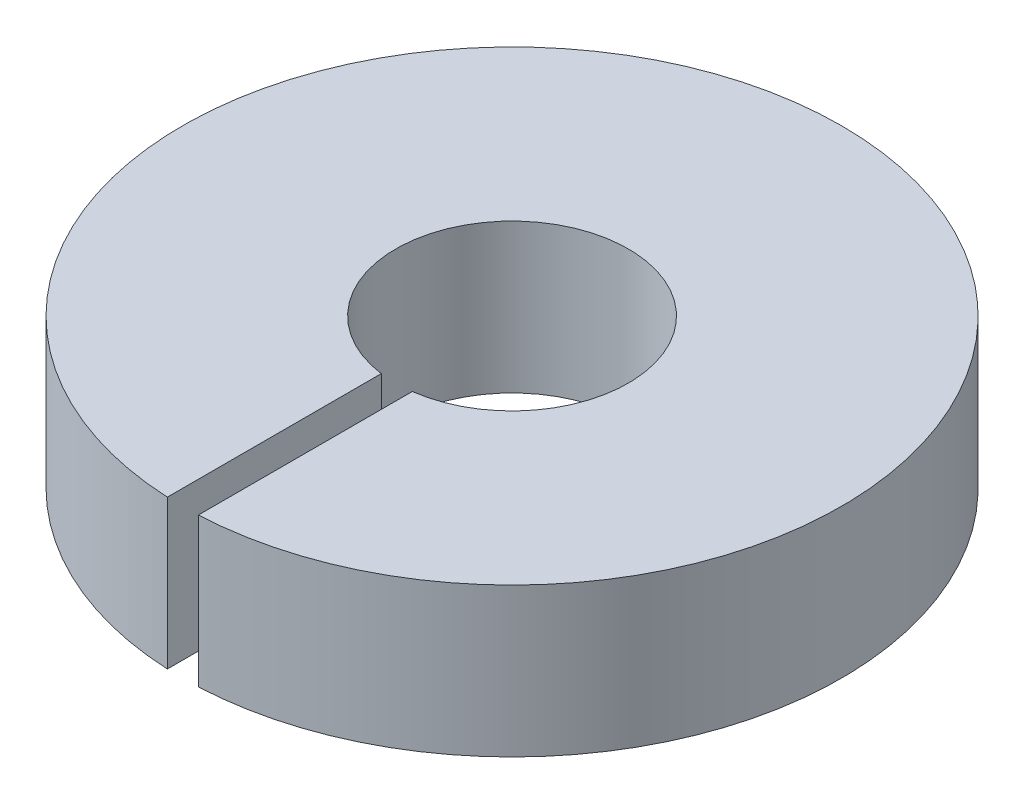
ISO-10303-21;
HEADER;
FILE_DESCRIPTION(('STEP AP214'),'2;1');
FILE_NAME('part.step','',(''),(''),'','','');
FILE_SCHEMA(('AUTOMOTIVE_DESIGN { 1 0 10303 214 1 1 1 1 }'));
ENDSEC;
DATA;
#1=APPLICATION_CONTEXT('core data for automotive mechanical design processes');
#2=APPLICATION_PROTOCOL_DEFINITION('international standard','automotive_design',2000,#1);
#3=PRODUCT_CONTEXT('',#1,'mechanical');
#4=PRODUCT('Part','Part','',(#3));
#5=PRODUCT_RELATED_PRODUCT_CATEGORY('part','',(#4));
#6=PRODUCT_DEFINITION_FORMATION('','',#4);
#7=PRODUCT_DEFINITION_CONTEXT('part definition',#1,'design');
#8=PRODUCT_DEFINITION('design','',#6,#7);
#9=PRODUCT_DEFINITION_SHAPE('','',#8);
#10=(LENGTH_UNIT() NAMED_UNIT(*) SI_UNIT(.MILLI.,.METRE.));
#11=(NAMED_UNIT(*) PLANE_ANGLE_UNIT() SI_UNIT($,.RADIAN.));
#12=(NAMED_UNIT(*) SI_UNIT($,.STERADIAN.) SOLID_ANGLE_UNIT());
#13=UNCERTAINTY_MEASURE_WITH_UNIT(LENGTH_MEASURE(1.E-05),#10,'distance_accuracy_value','');
#14=(GEOMETRIC_REPRESENTATION_CONTEXT(3) GLOBAL_UNCERTAINTY_ASSIGNED_CONTEXT((#13)) GLOBAL_UNIT_ASSIGNED_CONTEXT((#10,
#11,#12)) REPRESENTATION_CONTEXT('',''));
#15=CARTESIAN_POINT('',(0.,0.,0.));
#16=DIRECTION('',(0.,0.,1.));
#17=DIRECTION('',(1.,0.,0.));
#18=AXIS2_PLACEMENT_3D('',#15,#16,#17);
#19=CARTESIAN_POINT('',(0.,6.096,0.));
#20=DIRECTION('',(0.,-1.,0.));
#21=DIRECTION('',(0.,0.,-1.));
#22=AXIS2_PLACEMENT_3D('',#19,#20,#21);
#23=CYLINDRICAL_SURFACE('',#22,13.49375);
#24=CARTESIAN_POINT('',(0.,0.,0.));
#25=DIRECTION('',(0.,1.,0.));
#26=DIRECTION('',(0.,0.,1.));
#27=AXIS2_PLACEMENT_3D('',#24,#25,#26);
#28=CIRCLE('',#27,13.49375);
#29=CARTESIAN_POINT('',(0.635000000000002,0.,13.4788005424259));
#30=VERTEX_POINT('',#29);
#31=CARTESIAN_POINT('',(-0.634999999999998,0.,13.4788005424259));
#32=VERTEX_POINT('',#31);
#33=EDGE_CURVE('E100',#30,#32,#28,.T.);
#34=ORIENTED_EDGE('',*,*,#33,.T.);
#35=DIRECTION('',(0.,-1.,0.));
#36=VECTOR('',#35,1.);
#37=CARTESIAN_POINT('',(-0.634999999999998,6.096,13.4788005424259));
#38=LINE('',#37,#36);
#39=CARTESIAN_POINT('',(-0.634999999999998,6.096,13.4788005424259));
#40=VERTEX_POINT('',#39);
#41=EDGE_CURVE('E11',#40,#32,#38,.T.);
#42=ORIENTED_EDGE('',*,*,#41,.F.);
#43=CARTESIAN_POINT('',(0.,6.096,0.));
#44=DIRECTION('',(0.,1.,0.));
#45=DIRECTION('',(0.,0.,1.));
#46=AXIS2_PLACEMENT_3D('',#43,#44,#45);
#47=CIRCLE('',#46,13.49375);
#48=CARTESIAN_POINT('',(0.635000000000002,6.096,13.4788005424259));
#49=VERTEX_POINT('',#48);
#50=EDGE_CURVE('E87',#49,#40,#47,.T.);
#51=ORIENTED_EDGE('',*,*,#50,.F.);
#52=DIRECTION('',(0.,-1.,0.));
#53=VECTOR('',#52,1.);
#54=CARTESIAN_POINT('',(0.635000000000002,6.096,13.4788005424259));
#55=LINE('',#54,#53);
#56=EDGE_CURVE('E96',#49,#30,#55,.T.);
#57=ORIENTED_EDGE('',*,*,#56,.T.);
#58=EDGE_LOOP('',(#34,#42,#51,#57));
#59=FACE_BOUND('',#58,.T.);
#60=ADVANCED_FACE('F34',(#59),#23,.T.);
#61=CARTESIAN_POINT('',(-0.634999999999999,6.096,4.71997682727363));
#62=DIRECTION('',(-1.,0.,0.));
#63=DIRECTION('',(0.,0.,1.));
#64=AXIS2_PLACEMENT_3D('',#61,#62,#63);
#65=PLANE('',#64);
#66=CARTESIAN_POINT('',(-0.635000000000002,3.048,6.35));
#67=DIRECTION('',(-1.,0.,0.));
#68=DIRECTION('',(0.,0.,1.));
#69=AXIS2_PLACEMENT_3D('',#66,#67,#68);
#70=CIRCLE('',#69,1.1303);
#71=CARTESIAN_POINT('',(-0.635000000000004,3.048,5.2197));
#72=VERTEX_POINT('',#71);
#73=EDGE_CURVE('E103',#72,#72,#70,.T.);
#74=ORIENTED_EDGE('',*,*,#73,.T.);
#75=EDGE_LOOP('',(#74));
#76=FACE_BOUND('',#75,.T.);
#77=DIRECTION('',(0.,0.,-1.));
#78=VECTOR('',#77,1.);
#79=CARTESIAN_POINT('',(-0.634999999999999,0.,4.71997682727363));
#80=LINE('',#79,#78);
#81=CARTESIAN_POINT('',(-0.634999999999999,0.,4.71997682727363));
#82=VERTEX_POINT('',#81);
#83=EDGE_CURVE('E91',#32,#82,#80,.T.);
#84=ORIENTED_EDGE('',*,*,#83,.T.);
#85=DIRECTION('',(0.,-1.,0.));
#86=VECTOR('',#85,1.);
#87=CARTESIAN_POINT('',(-0.634999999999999,6.096,4.71997682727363));
#88=LINE('',#87,#86);
#89=CARTESIAN_POINT('',(-0.634999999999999,6.096,4.71997682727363));
#90=VERTEX_POINT('',#89);
#91=EDGE_CURVE('E43',#90,#82,#88,.T.);
#92=ORIENTED_EDGE('',*,*,#91,.F.);
#93=DIRECTION('',(0.,0.,-1.));
#94=VECTOR('',#93,1.);
#95=CARTESIAN_POINT('',(-0.634999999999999,6.096,4.71997682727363));
#96=LINE('',#95,#94);
#97=EDGE_CURVE('E82',#40,#90,#96,.T.);
#98=ORIENTED_EDGE('',*,*,#97,.F.);
#99=ORIENTED_EDGE('',*,*,#41,.T.);
#100=EDGE_LOOP('',(#84,#92,#98,#99));
#101=FACE_BOUND('',#100,.T.);
#102=ADVANCED_FACE('F90',(#76,#101),#65,.F.);
#103=CARTESIAN_POINT('',(0.,6.096,0.));
#104=DIRECTION('',(0.,-1.,0.));
#105=DIRECTION('',(0.,0.,-1.));
#106=AXIS2_PLACEMENT_3D('',#103,#104,#105);
#107=CYLINDRICAL_SURFACE('',#106,4.7625);
#108=CARTESIAN_POINT('',(0.,0.,0.));
#109=DIRECTION('',(0.,-1.,0.));
#110=DIRECTION('',(0.,0.,1.));
#111=AXIS2_PLACEMENT_3D('',#108,#109,#110);
#112=CIRCLE('',#111,4.7625);
#113=CARTESIAN_POINT('',(0.635,0.,4.71997682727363));
#114=VERTEX_POINT('',#113);
#115=EDGE_CURVE('E69',#82,#114,#112,.T.);
#116=ORIENTED_EDGE('',*,*,#115,.T.);
#117=DIRECTION('',(0.,-1.,0.));
#118=VECTOR('',#117,1.);
#119=CARTESIAN_POINT('',(0.635,6.096,4.71997682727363));
#120=LINE('',#119,#118);
#121=CARTESIAN_POINT('',(0.635,6.096,4.71997682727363));
#122=VERTEX_POINT('',#121);
#123=EDGE_CURVE('E92',#122,#114,#120,.T.);
#124=ORIENTED_EDGE('',*,*,#123,.F.);
#125=CARTESIAN_POINT('',(0.,6.096,0.));
#126=DIRECTION('',(0.,-1.,0.));
#127=DIRECTION('',(0.,0.,1.));
#128=AXIS2_PLACEMENT_3D('',#125,#126,#127);
#129=CIRCLE('',#128,4.7625);
#130=EDGE_CURVE('E85',#90,#122,#129,.T.);
#131=ORIENTED_EDGE('',*,*,#130,.F.);
#132=ORIENTED_EDGE('',*,*,#91,.T.);
#133=EDGE_LOOP('',(#116,#124,#131,#132));
#134=FACE_BOUND('',#133,.T.);
#135=ADVANCED_FACE('F94',(#134),#107,.F.);
#136=CARTESIAN_POINT('',(0.635000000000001,6.096,4.71997682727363));
#137=DIRECTION('',(1.,0.,0.));
#138=DIRECTION('',(0.,0.,-1.));
#139=AXIS2_PLACEMENT_3D('',#136,#137,#138);
#140=PLANE('',#139);
#141=CARTESIAN_POINT('',(0.634999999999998,3.048,6.35));
#142=DIRECTION('',(1.,0.,0.));
#143=DIRECTION('',(0.,0.,-1.));
#144=AXIS2_PLACEMENT_3D('',#141,#142,#143);
#145=CIRCLE('',#144,1.1303);
#146=CARTESIAN_POINT('',(0.634999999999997,3.048,5.2197));
#147=VERTEX_POINT('',#146);
#148=EDGE_CURVE('E108',#147,#147,#145,.T.);
#149=ORIENTED_EDGE('',*,*,#148,.T.);
#150=EDGE_LOOP('',(#149));
#151=FACE_BOUND('',#150,.T.);
#152=DIRECTION('',(0.,0.,1.));
#153=VECTOR('',#152,1.);
#154=CARTESIAN_POINT('',(0.635000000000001,0.,4.71997682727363));
#155=LINE('',#154,#153);
#156=EDGE_CURVE('E75',#114,#30,#155,.T.);
#157=ORIENTED_EDGE('',*,*,#156,.T.);
#158=ORIENTED_EDGE('',*,*,#56,.F.);
#159=DIRECTION('',(0.,0.,1.));
#160=VECTOR('',#159,1.);
#161=CARTESIAN_POINT('',(0.635000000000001,6.096,4.71997682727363));
#162=LINE('',#161,#160);
#163=EDGE_CURVE('E52',#122,#49,#162,.T.);
#164=ORIENTED_EDGE('',*,*,#163,.F.);
#165=ORIENTED_EDGE('',*,*,#123,.T.);
#166=EDGE_LOOP('',(#157,#158,#164,#165));
#167=FACE_BOUND('',#166,.T.);
#168=ADVANCED_FACE('F165',(#151,#167),#140,.F.);
#169=CARTESIAN_POINT('',(0.,6.096,0.));
#170=DIRECTION('',(0.,1.,0.));
#171=DIRECTION('',(0.,0.,1.));
#172=AXIS2_PLACEMENT_3D('',#169,#170,#171);
#173=PLANE('',#172);
#174=ORIENTED_EDGE('',*,*,#50,.T.);
#175=ORIENTED_EDGE('',*,*,#97,.T.);
#176=ORIENTED_EDGE('',*,*,#130,.T.);
#177=ORIENTED_EDGE('',*,*,#163,.T.);
#178=EDGE_LOOP('',(#174,#175,#176,#177));
#179=FACE_BOUND('',#178,.T.);
#180=ADVANCED_FACE('F83',(#179),#173,.T.);
#181=CARTESIAN_POINT('',(0.,0.,0.));
#182=DIRECTION('',(0.,1.,0.));
#183=DIRECTION('',(0.,0.,1.));
#184=AXIS2_PLACEMENT_3D('',#181,#182,#183);
#185=PLANE('',#184);
#186=ORIENTED_EDGE('',*,*,#33,.F.);
#187=ORIENTED_EDGE('',*,*,#156,.F.);
#188=ORIENTED_EDGE('',*,*,#115,.F.);
#189=ORIENTED_EDGE('',*,*,#83,.F.);
#190=EDGE_LOOP('',(#186,#187,#188,#189));
#191=FACE_BOUND('',#190,.T.);
#192=ADVANCED_FACE('F147',(#191),#185,.F.);
#193=CARTESIAN_POINT('',(-9.525,3.048,6.35));
#194=DIRECTION('',(1.,0.,0.));
#195=DIRECTION('',(0.,0.,-1.));
#196=AXIS2_PLACEMENT_3D('',#193,#194,#195);
#197=CYLINDRICAL_SURFACE('',#196,1.1303);
#198=CARTESIAN_POINT('',(3.175,3.048,6.35));
#199=DIRECTION('',(-1.,0.,0.));
#200=DIRECTION('',(0.,0.,1.));
#201=AXIS2_PLACEMENT_3D('',#198,#199,#200);
#202=CIRCLE('',#201,1.1303);
#203=CARTESIAN_POINT('',(3.175,3.048,5.2197));
#204=VERTEX_POINT('',#203);
#205=EDGE_CURVE('E37',#204,#204,#202,.F.);
#206=CARTESIAN_POINT('',(3.175,3.048,5.2197));
#207=CARTESIAN_POINT('',(3.14854166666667,3.048,5.2197));
#208=CARTESIAN_POINT('',(3.12208333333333,3.048,5.2197));
#209=CARTESIAN_POINT('',(3.06916666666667,3.048,5.2197));
#210=CARTESIAN_POINT('',(3.04270833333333,3.048,5.2197));
#211=CARTESIAN_POINT('',(2.98979166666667,3.048,5.2197));
#212=CARTESIAN_POINT('',(2.96333333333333,3.048,5.2197));
#213=CARTESIAN_POINT('',(2.91041666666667,3.048,5.2197));
#214=CARTESIAN_POINT('',(2.88395833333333,3.048,5.2197));
#215=CARTESIAN_POINT('',(2.83104166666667,3.048,5.2197));
#216=CARTESIAN_POINT('',(2.80458333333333,3.048,5.2197));
#217=CARTESIAN_POINT('',(2.75166666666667,3.048,5.2197));
#218=CARTESIAN_POINT('',(2.72520833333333,3.048,5.2197));
#219=CARTESIAN_POINT('',(2.67229166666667,3.048,5.2197));
#220=CARTESIAN_POINT('',(2.64583333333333,3.048,5.2197));
#221=CARTESIAN_POINT('',(2.59291666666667,3.048,5.2197));
#222=CARTESIAN_POINT('',(2.56645833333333,3.048,5.2197));
#223=CARTESIAN_POINT('',(2.51354166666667,3.048,5.2197));
#224=CARTESIAN_POINT('',(2.48708333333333,3.048,5.2197));
#225=CARTESIAN_POINT('',(2.43416666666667,3.048,5.2197));
#226=CARTESIAN_POINT('',(2.40770833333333,3.048,5.2197));
#227=CARTESIAN_POINT('',(2.35479166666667,3.048,5.2197));
#228=CARTESIAN_POINT('',(2.32833333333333,3.048,5.2197));
#229=CARTESIAN_POINT('',(2.27541666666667,3.048,5.2197));
#230=CARTESIAN_POINT('',(2.24895833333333,3.048,5.2197));
#231=CARTESIAN_POINT('',(2.19604166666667,3.048,5.2197));
#232=CARTESIAN_POINT('',(2.16958333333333,3.048,5.2197));
#233=CARTESIAN_POINT('',(2.11666666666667,3.048,5.2197));
#234=CARTESIAN_POINT('',(2.09020833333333,3.048,5.2197));
#235=CARTESIAN_POINT('',(2.03729166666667,3.048,5.2197));
#236=CARTESIAN_POINT('',(2.01083333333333,3.048,5.2197));
#237=CARTESIAN_POINT('',(1.95791666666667,3.048,5.2197));
#238=CARTESIAN_POINT('',(1.93145833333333,3.048,5.2197));
#239=CARTESIAN_POINT('',(1.87854166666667,3.048,5.2197));
#240=CARTESIAN_POINT('',(1.85208333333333,3.048,5.2197));
#241=CARTESIAN_POINT('',(1.79916666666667,3.048,5.2197));
#242=CARTESIAN_POINT('',(1.77270833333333,3.048,5.2197));
#243=CARTESIAN_POINT('',(1.71979166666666,3.048,5.2197));
#244=CARTESIAN_POINT('',(1.69333333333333,3.048,5.2197));
#245=CARTESIAN_POINT('',(1.64041666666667,3.048,5.2197));
#246=CARTESIAN_POINT('',(1.61395833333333,3.048,5.2197));
#247=CARTESIAN_POINT('',(1.56104166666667,3.048,5.2197));
#248=CARTESIAN_POINT('',(1.53458333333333,3.048,5.2197));
#249=CARTESIAN_POINT('',(1.48166666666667,3.048,5.2197));
#250=CARTESIAN_POINT('',(1.45520833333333,3.048,5.2197));
#251=CARTESIAN_POINT('',(1.40229166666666,3.048,5.2197));
#252=CARTESIAN_POINT('',(1.37583333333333,3.048,5.2197));
#253=CARTESIAN_POINT('',(1.32291666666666,3.048,5.2197));
#254=CARTESIAN_POINT('',(1.29645833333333,3.048,5.2197));
#255=CARTESIAN_POINT('',(1.24354166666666,3.048,5.2197));
#256=CARTESIAN_POINT('',(1.21708333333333,3.048,5.2197));
#257=CARTESIAN_POINT('',(1.16416666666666,3.048,5.2197));
#258=CARTESIAN_POINT('',(1.13770833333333,3.048,5.2197));
#259=CARTESIAN_POINT('',(1.08479166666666,3.048,5.2197));
#260=CARTESIAN_POINT('',(1.05833333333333,3.048,5.2197));
#261=CARTESIAN_POINT('',(1.00541666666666,3.048,5.2197));
#262=CARTESIAN_POINT('',(0.978958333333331,3.048,5.2197));
#263=CARTESIAN_POINT('',(0.926041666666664,3.048,5.2197));
#264=CARTESIAN_POINT('',(0.89958333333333,3.048,5.2197));
#265=CARTESIAN_POINT('',(0.846666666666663,3.048,5.2197));
#266=CARTESIAN_POINT('',(0.82020833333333,3.048,5.2197));
#267=CARTESIAN_POINT('',(0.767291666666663,3.048,5.2197));
#268=CARTESIAN_POINT('',(0.740833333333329,3.048,5.2197));
#269=CARTESIAN_POINT('',(0.687916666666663,3.048,5.2197));
#270=CARTESIAN_POINT('',(0.66145833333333,3.048,5.2197));
#271=CARTESIAN_POINT('',(0.634999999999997,3.048,5.2197));
#272=B_SPLINE_CURVE_WITH_KNOTS('',3,(#206,#207,#208,#209,#210,#211,#212,#213,#214,#215,#216,
#217,#218,#219,#220,#221,#222,#223,#224,#225,#226,#227,#228,#229,#230,#231,#232,#233,#234,#235,
#236,#237,#238,#239,#240,#241,#242,#243,#244,#245,#246,#247,#248,#249,#250,#251,#252,#253,#254,
#255,#256,#257,#258,#259,#260,#261,#262,#263,#264,#265,#266,#267,#268,#269,#270,#271),
.UNSPECIFIED.,.F.,.F.,(4,2,2,2,2,2,2,2,2,2,2,2,2,2,2,2,2,2,2,2,2,2,2,2,2,2,2,2,2,2,2,2,4),(0.,
0.0793749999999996,0.158750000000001,0.238125,0.3175,0.396875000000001,0.476250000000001,
0.555625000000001,0.635,0.714375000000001,0.793750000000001,0.873125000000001,0.952500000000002,
1.031875,1.11125,1.190625,1.27,1.349375,1.42875,1.508125,1.5875,1.666875,1.74625,1.825625,1.905,
1.984375,2.06375,2.143125,2.2225,2.301875,2.38125,2.460625,2.54),.UNSPECIFIED.);
#273=EDGE_CURVE('BSEAM143',#204,#147,#272,.T.);
#274=ORIENTED_EDGE('',*,*,#205,.T.);
#275=ORIENTED_EDGE('',*,*,#148,.F.);
#276=ORIENTED_EDGE('',*,*,#273,.T.);
#277=ORIENTED_EDGE('',*,*,#273,.F.);
#278=EDGE_LOOP('',(#274,#276,#275,#277));
#279=FACE_BOUND('',#278,.T.);
#280=ADVANCED_FACE('F143',(#279),#197,.F.);
#281=CARTESIAN_POINT('',(-9.525,3.048,6.35));
#282=DIRECTION('',(1.,0.,0.));
#283=DIRECTION('',(0.,0.,-1.));
#284=AXIS2_PLACEMENT_3D('',#281,#282,#283);
#285=CIRCLE('',#284,1.1303);
#286=CARTESIAN_POINT('',(-9.525,3.048,5.2197));
#287=VERTEX_POINT('',#286);
#288=EDGE_CURVE('E110',#287,#287,#285,.T.);
#289=CARTESIAN_POINT('',(-9.525,3.048,5.2197));
#290=CARTESIAN_POINT('',(-9.43239583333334,3.048,5.2197));
#291=CARTESIAN_POINT('',(-9.33979166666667,3.048,5.2197));
#292=CARTESIAN_POINT('',(-9.15458333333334,3.048,5.2197));
#293=CARTESIAN_POINT('',(-9.06197916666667,3.048,5.2197));
#294=CARTESIAN_POINT('',(-8.87677083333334,3.048,5.2197));
#295=CARTESIAN_POINT('',(-8.78416666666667,3.048,5.2197));
#296=CARTESIAN_POINT('',(-8.59895833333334,3.048,5.2197));
#297=CARTESIAN_POINT('',(-8.50635416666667,3.048,5.2197));
#298=CARTESIAN_POINT('',(-8.32114583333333,3.048,5.2197));
#299=CARTESIAN_POINT('',(-8.22854166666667,3.048,5.2197));
#300=CARTESIAN_POINT('',(-8.04333333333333,3.048,5.2197));
#301=CARTESIAN_POINT('',(-7.95072916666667,3.048,5.2197));
#302=CARTESIAN_POINT('',(-7.76552083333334,3.048,5.2197));
#303=CARTESIAN_POINT('',(-7.67291666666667,3.048,5.2197));
#304=CARTESIAN_POINT('',(-7.48770833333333,3.048,5.2197));
#305=CARTESIAN_POINT('',(-7.39510416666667,3.048,5.2197));
#306=CARTESIAN_POINT('',(-7.20989583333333,3.048,5.2197));
#307=CARTESIAN_POINT('',(-7.11729166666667,3.048,5.2197));
#308=CARTESIAN_POINT('',(-6.93208333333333,3.048,5.2197));
#309=CARTESIAN_POINT('',(-6.83947916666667,3.048,5.2197));
#310=CARTESIAN_POINT('',(-6.65427083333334,3.048,5.2197));
#311=CARTESIAN_POINT('',(-6.56166666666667,3.048,5.2197));
#312=CARTESIAN_POINT('',(-6.37645833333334,3.048,5.2197));
#313=CARTESIAN_POINT('',(-6.28385416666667,3.048,5.2197));
#314=CARTESIAN_POINT('',(-6.09864583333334,3.048,5.2197));
#315=CARTESIAN_POINT('',(-6.00604166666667,3.048,5.2197));
#316=CARTESIAN_POINT('',(-5.82083333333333,3.048,5.2197));
#317=CARTESIAN_POINT('',(-5.72822916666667,3.048,5.2197));
#318=CARTESIAN_POINT('',(-5.54302083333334,3.048,5.2197));
#319=CARTESIAN_POINT('',(-5.45041666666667,3.048,5.2197));
#320=CARTESIAN_POINT('',(-5.26520833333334,3.048,5.2197));
#321=CARTESIAN_POINT('',(-5.17260416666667,3.048,5.2197));
#322=CARTESIAN_POINT('',(-4.98739583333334,3.048,5.2197));
#323=CARTESIAN_POINT('',(-4.89479166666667,3.048,5.2197));
#324=CARTESIAN_POINT('',(-4.70958333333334,3.048,5.2197));
#325=CARTESIAN_POINT('',(-4.61697916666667,3.048,5.2197));
#326=CARTESIAN_POINT('',(-4.43177083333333,3.048,5.2197));
#327=CARTESIAN_POINT('',(-4.33916666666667,3.048,5.2197));
#328=CARTESIAN_POINT('',(-4.15395833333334,3.048,5.2197));
#329=CARTESIAN_POINT('',(-4.06135416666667,3.048,5.2197));
#330=CARTESIAN_POINT('',(-3.87614583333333,3.048,5.2197));
#331=CARTESIAN_POINT('',(-3.78354166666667,3.048,5.2197));
#332=CARTESIAN_POINT('',(-3.59833333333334,3.048,5.2197));
#333=CARTESIAN_POINT('',(-3.50572916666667,3.048,5.2197));
#334=CARTESIAN_POINT('',(-3.32052083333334,3.048,5.2197));
#335=CARTESIAN_POINT('',(-3.22791666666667,3.048,5.2197));
#336=CARTESIAN_POINT('',(-3.04270833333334,3.048,5.2197));
#337=CARTESIAN_POINT('',(-2.95010416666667,3.048,5.2197));
#338=CARTESIAN_POINT('',(-2.76489583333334,3.048,5.2197));
#339=CARTESIAN_POINT('',(-2.67229166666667,3.048,5.2197));
#340=CARTESIAN_POINT('',(-2.48708333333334,3.048,5.2197));
#341=CARTESIAN_POINT('',(-2.39447916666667,3.048,5.2197));
#342=CARTESIAN_POINT('',(-2.20927083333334,3.048,5.2197));
#343=CARTESIAN_POINT('',(-2.11666666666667,3.048,5.2197));
#344=CARTESIAN_POINT('',(-1.93145833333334,3.048,5.2197));
#345=CARTESIAN_POINT('',(-1.83885416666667,3.048,5.2197));
#346=CARTESIAN_POINT('',(-1.65364583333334,3.048,5.2197));
#347=CARTESIAN_POINT('',(-1.56104166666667,3.048,5.2197));
#348=CARTESIAN_POINT('',(-1.37583333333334,3.048,5.2197));
#349=CARTESIAN_POINT('',(-1.28322916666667,3.048,5.2197));
#350=CARTESIAN_POINT('',(-1.09802083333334,3.048,5.2197));
#351=CARTESIAN_POINT('',(-1.00541666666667,3.048,5.2197));
#352=CARTESIAN_POINT('',(-0.820208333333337,3.048,5.2197));
#353=CARTESIAN_POINT('',(-0.727604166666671,3.048,5.2197));
#354=CARTESIAN_POINT('',(-0.635000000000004,3.048,5.2197));
#355=B_SPLINE_CURVE_WITH_KNOTS('',3,(#289,#290,#291,#292,#293,#294,#295,#296,#297,#298,#299,
#300,#301,#302,#303,#304,#305,#306,#307,#308,#309,#310,#311,#312,#313,#314,#315,#316,#317,#318,
#319,#320,#321,#322,#323,#324,#325,#326,#327,#328,#329,#330,#331,#332,#333,#334,#335,#336,#337,
#338,#339,#340,#341,#342,#343,#344,#345,#346,#347,#348,#349,#350,#351,#352,#353,#354),
.UNSPECIFIED.,.F.,.F.,(4,2,2,2,2,2,2,2,2,2,2,2,2,2,2,2,2,2,2,2,2,2,2,2,2,2,2,2,2,2,2,2,4),(0.,
0.2778125,0.555625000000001,0.833437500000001,1.11125,1.3890625,1.666875,1.9446875,2.2225,
2.5003125,2.778125,3.0559375,3.33375,3.6115625,3.889375,4.1671875,4.445,4.7228125,5.000625,
5.2784375,5.55625,5.8340625,6.111875,6.3896875,6.6675,6.9453125,7.223125,7.5009375,7.77875,
8.0565625,8.334375,8.6121875,8.89),.UNSPECIFIED.);
#356=EDGE_CURVE('BSEAM146',#287,#72,#355,.T.);
#357=ORIENTED_EDGE('',*,*,#288,.F.);
#358=ORIENTED_EDGE('',*,*,#73,.F.);
#359=ORIENTED_EDGE('',*,*,#356,.T.);
#360=ORIENTED_EDGE('',*,*,#356,.F.);
#361=EDGE_LOOP('',(#357,#359,#358,#360));
#362=FACE_BOUND('',#361,.T.);
#363=ADVANCED_FACE('F146',(#362),#197,.F.);
#364=CARTESIAN_POINT('',(-9.525,3.048,6.35));
#365=DIRECTION('',(1.,0.,0.));
#366=DIRECTION('',(0.,0.,-1.));
#367=AXIS2_PLACEMENT_3D('',#364,#365,#366);
#368=PLANE('',#367);
#369=ORIENTED_EDGE('',*,*,#288,.T.);
#370=EDGE_LOOP('',(#369));
#371=FACE_BOUND('',#370,.T.);
#372=ADVANCED_FACE('F139',(#371),#368,.T.);
#373=CARTESIAN_POINT('',(3.175,3.048,6.35));
#374=DIRECTION('',(-1.,0.,0.));
#375=DIRECTION('',(0.,0.,1.));
#376=AXIS2_PLACEMENT_3D('',#373,#374,#375);
#377=PLANE('',#376);
#378=CARTESIAN_POINT('',(3.175,3.048,6.35));
#379=DIRECTION('',(-1.,0.,0.));
#380=DIRECTION('',(0.,0.,1.));
#381=AXIS2_PLACEMENT_3D('',#378,#379,#380);
#382=CIRCLE('',#381,2.38125);
#383=CARTESIAN_POINT('',(3.175,3.048,8.73125));
#384=VERTEX_POINT('',#383);
#385=EDGE_CURVE('E122',#384,#384,#382,.T.);
#386=ORIENTED_EDGE('',*,*,#385,.F.);
#387=EDGE_LOOP('',(#386));
#388=FACE_BOUND('',#387,.T.);
#389=ORIENTED_EDGE('',*,*,#205,.F.);
#390=EDGE_LOOP('',(#389));
#391=FACE_BOUND('',#390,.T.);
#392=ADVANCED_FACE('F133',(#388,#391),#377,.F.);
#393=CARTESIAN_POINT('',(10.033,3.048,6.35));
#394=DIRECTION('',(-1.,0.,0.));
#395=DIRECTION('',(0.,0.,1.));
#396=AXIS2_PLACEMENT_3D('',#393,#394,#395);
#397=CYLINDRICAL_SURFACE('',#396,2.38125);
#398=CARTESIAN_POINT('',(10.033,3.048,6.35));
#399=DIRECTION('',(-1.,0.,0.));
#400=DIRECTION('',(0.,0.,1.));
#401=AXIS2_PLACEMENT_3D('',#398,#399,#400);
#402=CIRCLE('',#401,2.38125);
#403=CARTESIAN_POINT('',(10.033,3.048,8.73125));
#404=VERTEX_POINT('',#403);
#405=EDGE_CURVE('E120',#404,#404,#402,.T.);
#406=ORIENTED_EDGE('',*,*,#405,.F.);
#407=EDGE_LOOP('',(#406));
#408=FACE_BOUND('',#407,.T.);
#409=ORIENTED_EDGE('',*,*,#385,.T.);
#410=EDGE_LOOP('',(#409));
#411=FACE_BOUND('',#410,.T.);
#412=ADVANCED_FACE('F130',(#408,#411),#397,.F.);
#413=CARTESIAN_POINT('',(10.033,3.048,6.35));
#414=DIRECTION('',(-1.,0.,0.));
#415=DIRECTION('',(0.,0.,1.));
#416=AXIS2_PLACEMENT_3D('',#413,#414,#415);
#417=PLANE('',#416);
#418=ORIENTED_EDGE('',*,*,#405,.T.);
#419=EDGE_LOOP('',(#418));
#420=FACE_BOUND('',#419,.T.);
#421=ADVANCED_FACE('F128',(#420),#417,.T.);
#422=CLOSED_SHELL('',(#60,#102,#135,#168,#180,#192,#280,#363,#372,#392,#412,#421));
#423=MANIFOLD_SOLID_BREP('B2',#422);
#424=ADVANCED_BREP_SHAPE_REPRESENTATION('',(#18,#423),#14);
#425=SHAPE_DEFINITION_REPRESENTATION(#9,#424);
ENDSEC;
END-ISO-10303-21;
